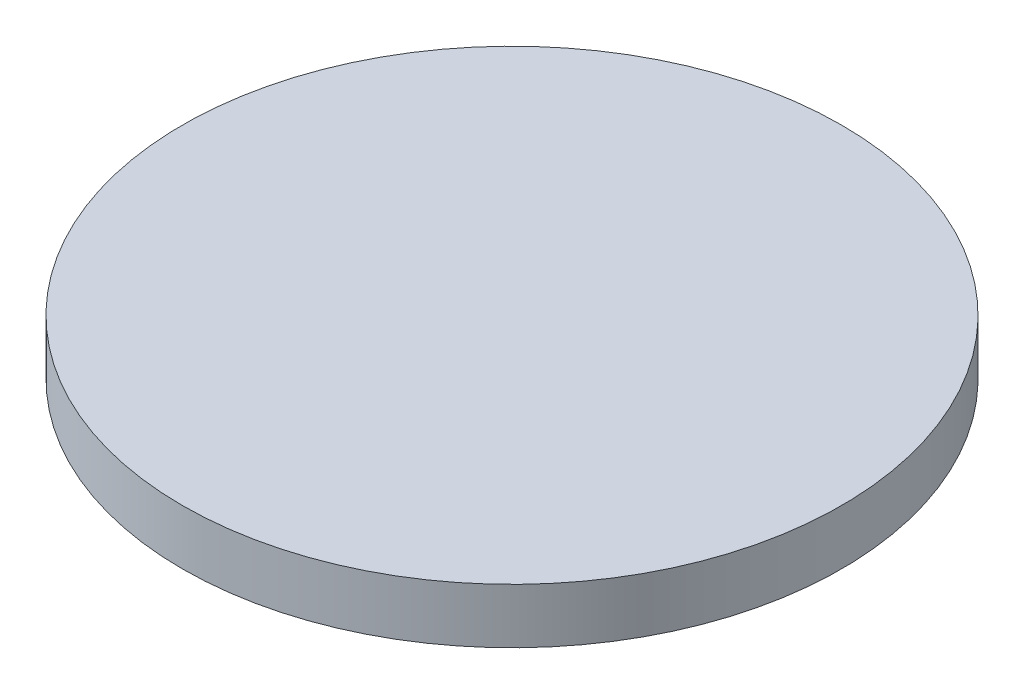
ISO-10303-21;
HEADER;
FILE_DESCRIPTION(('STEP AP214'),'2;1');
FILE_NAME('part.step','',(''),(''),'','','');
FILE_SCHEMA(('AUTOMOTIVE_DESIGN { 1 0 10303 214 1 1 1 1 }'));
ENDSEC;
DATA;
#1=APPLICATION_CONTEXT('core data for automotive mechanical design processes');
#2=APPLICATION_PROTOCOL_DEFINITION('international standard','automotive_design',2000,#1);
#3=PRODUCT_CONTEXT('',#1,'mechanical');
#4=PRODUCT('Part','Part','',(#3));
#5=PRODUCT_RELATED_PRODUCT_CATEGORY('part','',(#4));
#6=PRODUCT_DEFINITION_FORMATION('','',#4);
#7=PRODUCT_DEFINITION_CONTEXT('part definition',#1,'design');
#8=PRODUCT_DEFINITION('design','',#6,#7);
#9=PRODUCT_DEFINITION_SHAPE('','',#8);
#10=(LENGTH_UNIT() NAMED_UNIT(*) SI_UNIT(.MILLI.,.METRE.));
#11=(NAMED_UNIT(*) PLANE_ANGLE_UNIT() SI_UNIT($,.RADIAN.));
#12=(NAMED_UNIT(*) SI_UNIT($,.STERADIAN.) SOLID_ANGLE_UNIT());
#13=UNCERTAINTY_MEASURE_WITH_UNIT(LENGTH_MEASURE(1.E-05),#10,'distance_accuracy_value','');
#14=(GEOMETRIC_REPRESENTATION_CONTEXT(3) GLOBAL_UNCERTAINTY_ASSIGNED_CONTEXT((#13)) GLOBAL_UNIT_ASSIGNED_CONTEXT((#10,
#11,#12)) REPRESENTATION_CONTEXT('',''));
#15=CARTESIAN_POINT('',(0.,0.,0.));
#16=DIRECTION('',(0.,0.,1.));
#17=DIRECTION('',(1.,0.,0.));
#18=AXIS2_PLACEMENT_3D('',#15,#16,#17);
#19=CARTESIAN_POINT('',(0.,2.5,0.));
#20=DIRECTION('',(0.,-1.,0.));
#21=DIRECTION('',(0.,0.,-1.));
#22=AXIS2_PLACEMENT_3D('',#19,#20,#21);
#23=CYLINDRICAL_SURFACE('',#22,15.);
#24=CARTESIAN_POINT('',(0.,2.5,0.));
#25=DIRECTION('',(0.,1.,0.));
#26=DIRECTION('',(0.,0.,1.));
#27=AXIS2_PLACEMENT_3D('',#24,#25,#26);
#28=CIRCLE('',#27,15.);
#29=CARTESIAN_POINT('',(0.,2.5,15.));
#30=VERTEX_POINT('',#29);
#31=EDGE_CURVE('E10',#30,#30,#28,.T.);
#32=ORIENTED_EDGE('',*,*,#31,.F.);
#33=EDGE_LOOP('',(#32));
#34=FACE_BOUND('',#33,.T.);
#35=CARTESIAN_POINT('',(0.,0.,0.));
#36=DIRECTION('',(0.,1.,0.));
#37=DIRECTION('',(0.,0.,1.));
#38=AXIS2_PLACEMENT_3D('',#35,#36,#37);
#39=CIRCLE('',#38,15.);
#40=CARTESIAN_POINT('',(0.,0.,15.));
#41=VERTEX_POINT('',#40);
#42=EDGE_CURVE('E43',#41,#41,#39,.T.);
#43=ORIENTED_EDGE('',*,*,#42,.T.);
#44=EDGE_LOOP('',(#43));
#45=FACE_BOUND('',#44,.T.);
#46=ADVANCED_FACE('F40',(#34,#45),#23,.T.);
#47=CARTESIAN_POINT('',(0.,2.5,0.));
#48=DIRECTION('',(0.,1.,0.));
#49=DIRECTION('',(0.,0.,1.));
#50=AXIS2_PLACEMENT_3D('',#47,#48,#49);
#51=PLANE('',#50);
#52=ORIENTED_EDGE('',*,*,#31,.T.);
#53=EDGE_LOOP('',(#52));
#54=FACE_BOUND('',#53,.T.);
#55=ADVANCED_FACE('F55',(#54),#51,.T.);
#56=CARTESIAN_POINT('',(0.,0.,0.));
#57=DIRECTION('',(0.,1.,0.));
#58=DIRECTION('',(0.,0.,1.));
#59=AXIS2_PLACEMENT_3D('',#56,#57,#58);
#60=PLANE('',#59);
#61=ORIENTED_EDGE('',*,*,#42,.F.);
#62=EDGE_LOOP('',(#61));
#63=FACE_BOUND('',#62,.T.);
#64=ADVANCED_FACE('F53',(#63),#60,.F.);
#65=CLOSED_SHELL('',(#46,#55,#64));
#66=MANIFOLD_SOLID_BREP('B2',#65);
#67=ADVANCED_BREP_SHAPE_REPRESENTATION('',(#18,#66),#14);
#68=SHAPE_DEFINITION_REPRESENTATION(#9,#67);
ENDSEC;
END-ISO-10303-21;
